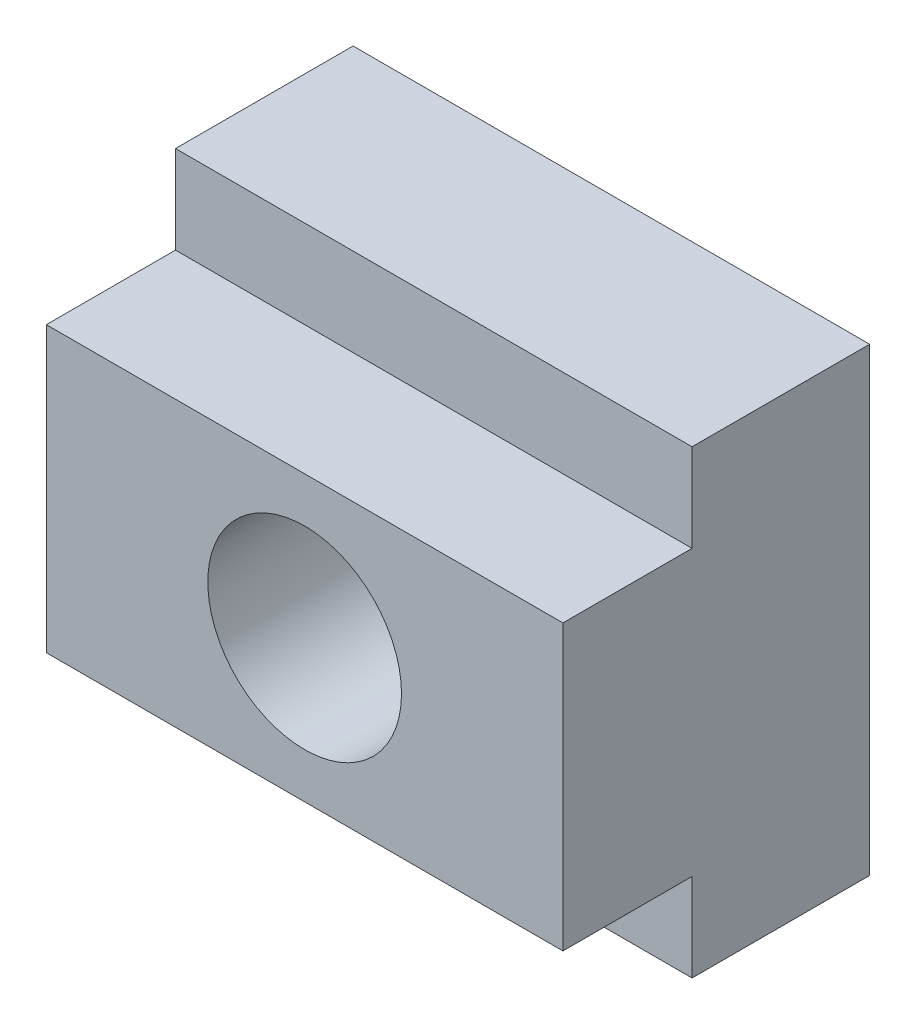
ISO-10303-21;
HEADER;
FILE_DESCRIPTION(('STEP AP214'),'2;1');
FILE_NAME('part.step','',(''),(''),'','','');
FILE_SCHEMA(('AUTOMOTIVE_DESIGN { 1 0 10303 214 1 1 1 1 }'));
ENDSEC;
DATA;
#1=APPLICATION_CONTEXT('core data for automotive mechanical design processes');
#2=APPLICATION_PROTOCOL_DEFINITION('international standard','automotive_design',2000,#1);
#3=PRODUCT_CONTEXT('',#1,'mechanical');
#4=PRODUCT('Part','Part','',(#3));
#5=PRODUCT_RELATED_PRODUCT_CATEGORY('part','',(#4));
#6=PRODUCT_DEFINITION_FORMATION('','',#4);
#7=PRODUCT_DEFINITION_CONTEXT('part definition',#1,'design');
#8=PRODUCT_DEFINITION('design','',#6,#7);
#9=PRODUCT_DEFINITION_SHAPE('','',#8);
#10=(LENGTH_UNIT() NAMED_UNIT(*) SI_UNIT(.MILLI.,.METRE.));
#11=(NAMED_UNIT(*) PLANE_ANGLE_UNIT() SI_UNIT($,.RADIAN.));
#12=(NAMED_UNIT(*) SI_UNIT($,.STERADIAN.) SOLID_ANGLE_UNIT());
#13=UNCERTAINTY_MEASURE_WITH_UNIT(LENGTH_MEASURE(1.E-05),#10,'distance_accuracy_value','');
#14=(GEOMETRIC_REPRESENTATION_CONTEXT(3) GLOBAL_UNCERTAINTY_ASSIGNED_CONTEXT((#13)) GLOBAL_UNIT_ASSIGNED_CONTEXT((#10,
#11,#12)) REPRESENTATION_CONTEXT('',''));
#15=CARTESIAN_POINT('',(0.,0.,0.));
#16=DIRECTION('',(0.,0.,1.));
#17=DIRECTION('',(1.,0.,0.));
#18=AXIS2_PLACEMENT_3D('',#15,#16,#17);
#19=CARTESIAN_POINT('',(16.,-8.8,8.));
#20=DIRECTION('',(0.,1.,0.));
#21=DIRECTION('',(0.,0.,1.));
#22=AXIS2_PLACEMENT_3D('',#19,#20,#21);
#23=PLANE('',#22);
#24=DIRECTION('',(0.,0.,-1.));
#25=VECTOR('',#24,1.);
#26=CARTESIAN_POINT('',(-16.,-8.8,8.));
#27=LINE('',#26,#25);
#28=CARTESIAN_POINT('',(-16.,-8.8,8.));
#29=VERTEX_POINT('',#28);
#30=CARTESIAN_POINT('',(-16.,-8.8,0.));
#31=VERTEX_POINT('',#30);
#32=EDGE_CURVE('E110',#29,#31,#27,.T.);
#33=ORIENTED_EDGE('',*,*,#32,.T.);
#34=DIRECTION('',(-1.,0.,0.));
#35=VECTOR('',#34,1.);
#36=CARTESIAN_POINT('',(16.,-8.8,0.));
#37=LINE('',#36,#35);
#38=CARTESIAN_POINT('',(16.,-8.8,0.));
#39=VERTEX_POINT('',#38);
#40=EDGE_CURVE('E9',#39,#31,#37,.T.);
#41=ORIENTED_EDGE('',*,*,#40,.F.);
#42=DIRECTION('',(0.,0.,-1.));
#43=VECTOR('',#42,1.);
#44=CARTESIAN_POINT('',(16.,-8.8,8.));
#45=LINE('',#44,#43);
#46=CARTESIAN_POINT('',(16.,-8.8,8.));
#47=VERTEX_POINT('',#46);
#48=EDGE_CURVE('E125',#47,#39,#45,.T.);
#49=ORIENTED_EDGE('',*,*,#48,.F.);
#50=DIRECTION('',(-1.,0.,0.));
#51=VECTOR('',#50,1.);
#52=CARTESIAN_POINT('',(16.,-8.8,8.));
#53=LINE('',#52,#51);
#54=EDGE_CURVE('E106',#47,#29,#53,.T.);
#55=ORIENTED_EDGE('',*,*,#54,.T.);
#56=EDGE_LOOP('',(#33,#41,#49,#55));
#57=FACE_BOUND('',#56,.T.);
#58=ADVANCED_FACE('F14',(#57),#23,.F.);
#59=CARTESIAN_POINT('',(16.,-14.25,0.));
#60=DIRECTION('',(0.,0.,-1.));
#61=DIRECTION('',(-1.,0.,0.));
#62=AXIS2_PLACEMENT_3D('',#59,#60,#61);
#63=PLANE('',#62);
#64=DIRECTION('',(0.,-1.,0.));
#65=VECTOR('',#64,1.);
#66=CARTESIAN_POINT('',(-16.,-14.25,0.));
#67=LINE('',#66,#65);
#68=CARTESIAN_POINT('',(-16.,-14.25,0.));
#69=VERTEX_POINT('',#68);
#70=EDGE_CURVE('E113',#31,#69,#67,.T.);
#71=ORIENTED_EDGE('',*,*,#70,.T.);
#72=DIRECTION('',(-1.,0.,0.));
#73=VECTOR('',#72,1.);
#74=CARTESIAN_POINT('',(16.,-14.25,0.));
#75=LINE('',#74,#73);
#76=CARTESIAN_POINT('',(16.,-14.25,0.));
#77=VERTEX_POINT('',#76);
#78=EDGE_CURVE('E22',#77,#69,#75,.T.);
#79=ORIENTED_EDGE('',*,*,#78,.F.);
#80=DIRECTION('',(0.,-1.,0.));
#81=VECTOR('',#80,1.);
#82=CARTESIAN_POINT('',(16.,-14.25,0.));
#83=LINE('',#82,#81);
#84=EDGE_CURVE('E73',#39,#77,#83,.T.);
#85=ORIENTED_EDGE('',*,*,#84,.F.);
#86=ORIENTED_EDGE('',*,*,#40,.T.);
#87=EDGE_LOOP('',(#71,#79,#85,#86));
#88=FACE_BOUND('',#87,.T.);
#89=ADVANCED_FACE('F184',(#88),#63,.F.);
#90=CARTESIAN_POINT('',(16.,-14.25,0.));
#91=DIRECTION('',(0.,1.,0.));
#92=DIRECTION('',(-1.,0.,0.));
#93=AXIS2_PLACEMENT_3D('',#90,#91,#92);
#94=PLANE('',#93);
#95=DIRECTION('',(0.,0.,-1.));
#96=VECTOR('',#95,1.);
#97=CARTESIAN_POINT('',(-16.,-14.25,0.));
#98=LINE('',#97,#96);
#99=CARTESIAN_POINT('',(-16.,-14.25,-11.));
#100=VERTEX_POINT('',#99);
#101=EDGE_CURVE('E116',#69,#100,#98,.T.);
#102=ORIENTED_EDGE('',*,*,#101,.T.);
#103=DIRECTION('',(-1.,0.,0.));
#104=VECTOR('',#103,1.);
#105=CARTESIAN_POINT('',(16.,-14.25,-11.));
#106=LINE('',#105,#104);
#107=CARTESIAN_POINT('',(16.,-14.25,-11.));
#108=VERTEX_POINT('',#107);
#109=EDGE_CURVE('E132',#108,#100,#106,.T.);
#110=ORIENTED_EDGE('',*,*,#109,.F.);
#111=DIRECTION('',(0.,0.,-1.));
#112=VECTOR('',#111,1.);
#113=CARTESIAN_POINT('',(16.,-14.25,0.));
#114=LINE('',#113,#112);
#115=EDGE_CURVE('E140',#77,#108,#114,.T.);
#116=ORIENTED_EDGE('',*,*,#115,.F.);
#117=ORIENTED_EDGE('',*,*,#78,.T.);
#118=EDGE_LOOP('',(#102,#110,#116,#117));
#119=FACE_BOUND('',#118,.T.);
#120=ADVANCED_FACE('F138',(#119),#94,.F.);
#121=CARTESIAN_POINT('',(16.,-14.25,-11.));
#122=DIRECTION('',(0.,0.,1.));
#123=DIRECTION('',(0.,-1.,0.));
#124=AXIS2_PLACEMENT_3D('',#121,#122,#123);
#125=PLANE('',#124);
#126=CARTESIAN_POINT('',(0.,0.,-11.));
#127=DIRECTION('',(0.,0.,1.));
#128=DIRECTION('',(1.,0.,0.));
#129=AXIS2_PLACEMENT_3D('',#126,#127,#128);
#130=CIRCLE('',#129,6.);
#131=CARTESIAN_POINT('',(6.,0.,-11.));
#132=VERTEX_POINT('',#131);
#133=EDGE_CURVE('E114',#132,#132,#130,.T.);
#134=ORIENTED_EDGE('',*,*,#133,.T.);
#135=EDGE_LOOP('',(#134));
#136=FACE_BOUND('',#135,.T.);
#137=DIRECTION('',(0.,1.,0.));
#138=VECTOR('',#137,1.);
#139=CARTESIAN_POINT('',(-16.,-14.25,-11.));
#140=LINE('',#139,#138);
#141=CARTESIAN_POINT('',(-16.,14.25,-11.));
#142=VERTEX_POINT('',#141);
#143=EDGE_CURVE('E118',#100,#142,#140,.T.);
#144=ORIENTED_EDGE('',*,*,#143,.T.);
#145=DIRECTION('',(-1.,0.,0.));
#146=VECTOR('',#145,1.);
#147=CARTESIAN_POINT('',(16.,14.25,-11.));
#148=LINE('',#147,#146);
#149=CARTESIAN_POINT('',(16.,14.25,-11.));
#150=VERTEX_POINT('',#149);
#151=EDGE_CURVE('E129',#150,#142,#148,.T.);
#152=ORIENTED_EDGE('',*,*,#151,.F.);
#153=DIRECTION('',(0.,1.,0.));
#154=VECTOR('',#153,1.);
#155=CARTESIAN_POINT('',(16.,-14.25,-11.));
#156=LINE('',#155,#154);
#157=EDGE_CURVE('E152',#108,#150,#156,.T.);
#158=ORIENTED_EDGE('',*,*,#157,.F.);
#159=ORIENTED_EDGE('',*,*,#109,.T.);
#160=EDGE_LOOP('',(#144,#152,#158,#159));
#161=FACE_BOUND('',#160,.T.);
#162=ADVANCED_FACE('F148',(#136,#161),#125,.F.);
#163=CARTESIAN_POINT('',(16.,14.25,0.));
#164=DIRECTION('',(0.,-1.,0.));
#165=DIRECTION('',(0.,0.,-1.));
#166=AXIS2_PLACEMENT_3D('',#163,#164,#165);
#167=PLANE('',#166);
#168=DIRECTION('',(0.,0.,1.));
#169=VECTOR('',#168,1.);
#170=CARTESIAN_POINT('',(-16.,14.25,0.));
#171=LINE('',#170,#169);
#172=CARTESIAN_POINT('',(-16.,14.25,0.));
#173=VERTEX_POINT('',#172);
#174=EDGE_CURVE('E120',#142,#173,#171,.T.);
#175=ORIENTED_EDGE('',*,*,#174,.T.);
#176=DIRECTION('',(-1.,0.,0.));
#177=VECTOR('',#176,1.);
#178=CARTESIAN_POINT('',(16.,14.25,0.));
#179=LINE('',#178,#177);
#180=CARTESIAN_POINT('',(16.,14.25,0.));
#181=VERTEX_POINT('',#180);
#182=EDGE_CURVE('E101',#181,#173,#179,.T.);
#183=ORIENTED_EDGE('',*,*,#182,.F.);
#184=DIRECTION('',(0.,0.,1.));
#185=VECTOR('',#184,1.);
#186=CARTESIAN_POINT('',(16.,14.25,0.));
#187=LINE('',#186,#185);
#188=EDGE_CURVE('E92',#150,#181,#187,.T.);
#189=ORIENTED_EDGE('',*,*,#188,.F.);
#190=ORIENTED_EDGE('',*,*,#151,.T.);
#191=EDGE_LOOP('',(#175,#183,#189,#190));
#192=FACE_BOUND('',#191,.T.);
#193=ADVANCED_FACE('F151',(#192),#167,.F.);
#194=CARTESIAN_POINT('',(16.,8.8,0.));
#195=DIRECTION('',(0.,0.,-1.));
#196=DIRECTION('',(-1.,0.,0.));
#197=AXIS2_PLACEMENT_3D('',#194,#195,#196);
#198=PLANE('',#197);
#199=DIRECTION('',(0.,-1.,0.));
#200=VECTOR('',#199,1.);
#201=CARTESIAN_POINT('',(-16.,8.8,0.));
#202=LINE('',#201,#200);
#203=CARTESIAN_POINT('',(-16.,8.8,0.));
#204=VERTEX_POINT('',#203);
#205=EDGE_CURVE('E100',#173,#204,#202,.T.);
#206=ORIENTED_EDGE('',*,*,#205,.T.);
#207=DIRECTION('',(-1.,0.,0.));
#208=VECTOR('',#207,1.);
#209=CARTESIAN_POINT('',(16.,8.8,0.));
#210=LINE('',#209,#208);
#211=CARTESIAN_POINT('',(16.,8.8,0.));
#212=VERTEX_POINT('',#211);
#213=EDGE_CURVE('E97',#212,#204,#210,.T.);
#214=ORIENTED_EDGE('',*,*,#213,.F.);
#215=DIRECTION('',(0.,-1.,0.));
#216=VECTOR('',#215,1.);
#217=CARTESIAN_POINT('',(16.,8.8,0.));
#218=LINE('',#217,#216);
#219=EDGE_CURVE('E86',#181,#212,#218,.T.);
#220=ORIENTED_EDGE('',*,*,#219,.F.);
#221=ORIENTED_EDGE('',*,*,#182,.T.);
#222=EDGE_LOOP('',(#206,#214,#220,#221));
#223=FACE_BOUND('',#222,.T.);
#224=ADVANCED_FACE('F98',(#223),#198,.F.);
#225=CARTESIAN_POINT('',(16.,8.8,8.));
#226=DIRECTION('',(0.,-1.,0.));
#227=DIRECTION('',(0.,0.,-1.));
#228=AXIS2_PLACEMENT_3D('',#225,#226,#227);
#229=PLANE('',#228);
#230=DIRECTION('',(0.,0.,1.));
#231=VECTOR('',#230,1.);
#232=CARTESIAN_POINT('',(-16.,8.8,8.));
#233=LINE('',#232,#231);
#234=CARTESIAN_POINT('',(-16.,8.8,8.));
#235=VERTEX_POINT('',#234);
#236=EDGE_CURVE('E59',#204,#235,#233,.T.);
#237=ORIENTED_EDGE('',*,*,#236,.T.);
#238=DIRECTION('',(-1.,0.,0.));
#239=VECTOR('',#238,1.);
#240=CARTESIAN_POINT('',(16.,8.8,8.));
#241=LINE('',#240,#239);
#242=CARTESIAN_POINT('',(16.,8.8,8.));
#243=VERTEX_POINT('',#242);
#244=EDGE_CURVE('E102',#243,#235,#241,.T.);
#245=ORIENTED_EDGE('',*,*,#244,.F.);
#246=DIRECTION('',(0.,0.,1.));
#247=VECTOR('',#246,1.);
#248=CARTESIAN_POINT('',(16.,8.8,8.));
#249=LINE('',#248,#247);
#250=EDGE_CURVE('E90',#212,#243,#249,.T.);
#251=ORIENTED_EDGE('',*,*,#250,.F.);
#252=ORIENTED_EDGE('',*,*,#213,.T.);
#253=EDGE_LOOP('',(#237,#245,#251,#252));
#254=FACE_BOUND('',#253,.T.);
#255=ADVANCED_FACE('F104',(#254),#229,.F.);
#256=CARTESIAN_POINT('',(16.,-8.8,8.));
#257=DIRECTION('',(0.,0.,-1.));
#258=DIRECTION('',(0.,1.,0.));
#259=AXIS2_PLACEMENT_3D('',#256,#257,#258);
#260=PLANE('',#259);
#261=CARTESIAN_POINT('',(0.,0.,8.));
#262=DIRECTION('',(0.,0.,1.));
#263=DIRECTION('',(1.,0.,0.));
#264=AXIS2_PLACEMENT_3D('',#261,#262,#263);
#265=CIRCLE('',#264,6.);
#266=CARTESIAN_POINT('',(6.,0.,8.));
#267=VERTEX_POINT('',#266);
#268=EDGE_CURVE('E158',#267,#267,#265,.T.);
#269=ORIENTED_EDGE('',*,*,#268,.F.);
#270=EDGE_LOOP('',(#269));
#271=FACE_BOUND('',#270,.T.);
#272=DIRECTION('',(0.,-1.,0.));
#273=VECTOR('',#272,1.);
#274=CARTESIAN_POINT('',(-16.,-8.8,8.));
#275=LINE('',#274,#273);
#276=EDGE_CURVE('E65',#235,#29,#275,.T.);
#277=ORIENTED_EDGE('',*,*,#276,.T.);
#278=ORIENTED_EDGE('',*,*,#54,.F.);
#279=DIRECTION('',(0.,-1.,0.));
#280=VECTOR('',#279,1.);
#281=CARTESIAN_POINT('',(16.,-8.8,8.));
#282=LINE('',#281,#280);
#283=EDGE_CURVE('E30',#243,#47,#282,.T.);
#284=ORIENTED_EDGE('',*,*,#283,.F.);
#285=ORIENTED_EDGE('',*,*,#244,.T.);
#286=EDGE_LOOP('',(#277,#278,#284,#285));
#287=FACE_BOUND('',#286,.T.);
#288=ADVANCED_FACE('F171',(#271,#287),#260,.F.);
#289=CARTESIAN_POINT('',(16.,0.,8.));
#290=DIRECTION('',(1.,0.,0.));
#291=DIRECTION('',(0.,1.,0.));
#292=AXIS2_PLACEMENT_3D('',#289,#290,#291);
#293=PLANE('',#292);
#294=ORIENTED_EDGE('',*,*,#48,.T.);
#295=ORIENTED_EDGE('',*,*,#84,.T.);
#296=ORIENTED_EDGE('',*,*,#115,.T.);
#297=ORIENTED_EDGE('',*,*,#157,.T.);
#298=ORIENTED_EDGE('',*,*,#188,.T.);
#299=ORIENTED_EDGE('',*,*,#219,.T.);
#300=ORIENTED_EDGE('',*,*,#250,.T.);
#301=ORIENTED_EDGE('',*,*,#283,.T.);
#302=EDGE_LOOP('',(#294,#295,#296,#297,#298,#299,#300,#301));
#303=FACE_BOUND('',#302,.T.);
#304=ADVANCED_FACE('F88',(#303),#293,.T.);
#305=CARTESIAN_POINT('',(-16.,0.,8.));
#306=DIRECTION('',(1.,0.,0.));
#307=DIRECTION('',(0.,1.,0.));
#308=AXIS2_PLACEMENT_3D('',#305,#306,#307);
#309=PLANE('',#308);
#310=ORIENTED_EDGE('',*,*,#32,.F.);
#311=ORIENTED_EDGE('',*,*,#276,.F.);
#312=ORIENTED_EDGE('',*,*,#236,.F.);
#313=ORIENTED_EDGE('',*,*,#205,.F.);
#314=ORIENTED_EDGE('',*,*,#174,.F.);
#315=ORIENTED_EDGE('',*,*,#143,.F.);
#316=ORIENTED_EDGE('',*,*,#101,.F.);
#317=ORIENTED_EDGE('',*,*,#70,.F.);
#318=EDGE_LOOP('',(#310,#311,#312,#313,#314,#315,#316,#317));
#319=FACE_BOUND('',#318,.T.);
#320=ADVANCED_FACE('F144',(#319),#309,.F.);
#321=CARTESIAN_POINT('',(0.,0.,-11.));
#322=DIRECTION('',(0.,0.,1.));
#323=DIRECTION('',(1.,0.,0.));
#324=AXIS2_PLACEMENT_3D('',#321,#322,#323);
#325=CYLINDRICAL_SURFACE('',#324,6.);
#326=ORIENTED_EDGE('',*,*,#133,.F.);
#327=EDGE_LOOP('',(#326));
#328=FACE_BOUND('',#327,.T.);
#329=ORIENTED_EDGE('',*,*,#268,.T.);
#330=EDGE_LOOP('',(#329));
#331=FACE_BOUND('',#330,.T.);
#332=ADVANCED_FACE('F165',(#328,#331),#325,.F.);
#333=CLOSED_SHELL('',(#58,#89,#120,#162,#193,#224,#255,#288,#304,#320,#332));
#334=MANIFOLD_SOLID_BREP('B1',#333);
#335=ADVANCED_BREP_SHAPE_REPRESENTATION('',(#18,#334),#14);
#336=SHAPE_DEFINITION_REPRESENTATION(#9,#335);
ENDSEC;
END-ISO-10303-21;
